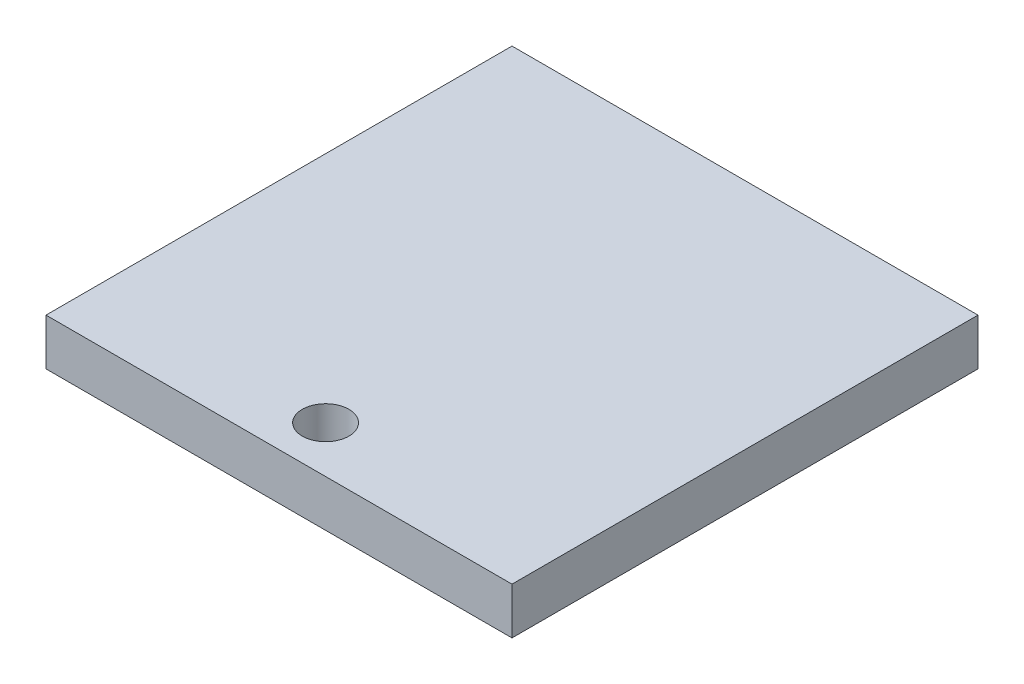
ISO-10303-21;
HEADER;
FILE_DESCRIPTION(('STEP AP214'),'2;1');
FILE_NAME('part.step','',(''),(''),'','','');
FILE_SCHEMA(('AUTOMOTIVE_DESIGN { 1 0 10303 214 1 1 1 1 }'));
ENDSEC;
DATA;
#1=APPLICATION_CONTEXT('core data for automotive mechanical design processes');
#2=APPLICATION_PROTOCOL_DEFINITION('international standard','automotive_design',2000,#1);
#3=PRODUCT_CONTEXT('',#1,'mechanical');
#4=PRODUCT('Part','Part','',(#3));
#5=PRODUCT_RELATED_PRODUCT_CATEGORY('part','',(#4));
#6=PRODUCT_DEFINITION_FORMATION('','',#4);
#7=PRODUCT_DEFINITION_CONTEXT('part definition',#1,'design');
#8=PRODUCT_DEFINITION('design','',#6,#7);
#9=PRODUCT_DEFINITION_SHAPE('','',#8);
#10=(LENGTH_UNIT() NAMED_UNIT(*) SI_UNIT(.MILLI.,.METRE.));
#11=(NAMED_UNIT(*) PLANE_ANGLE_UNIT() SI_UNIT($,.RADIAN.));
#12=(NAMED_UNIT(*) SI_UNIT($,.STERADIAN.) SOLID_ANGLE_UNIT());
#13=UNCERTAINTY_MEASURE_WITH_UNIT(LENGTH_MEASURE(1.E-05),#10,'distance_accuracy_value','');
#14=(GEOMETRIC_REPRESENTATION_CONTEXT(3) GLOBAL_UNCERTAINTY_ASSIGNED_CONTEXT((#13)) GLOBAL_UNIT_ASSIGNED_CONTEXT((#10,
#11,#12)) REPRESENTATION_CONTEXT('',''));
#15=CARTESIAN_POINT('',(0.,0.,0.));
#16=DIRECTION('',(0.,0.,1.));
#17=DIRECTION('',(1.,0.,0.));
#18=AXIS2_PLACEMENT_3D('',#15,#16,#17);
#19=CARTESIAN_POINT('',(0.,5.,0.));
#20=DIRECTION('',(1.,0.,0.));
#21=DIRECTION('',(0.,0.,-1.));
#22=AXIS2_PLACEMENT_3D('',#19,#20,#21);
#23=PLANE('',#22);
#24=DIRECTION('',(0.,0.,1.));
#25=VECTOR('',#24,1.);
#26=CARTESIAN_POINT('',(0.,0.,0.));
#27=LINE('',#26,#25);
#28=CARTESIAN_POINT('',(0.,0.,-50.));
#29=VERTEX_POINT('',#28);
#30=CARTESIAN_POINT('',(0.,0.,0.));
#31=VERTEX_POINT('',#30);
#32=EDGE_CURVE('E77',#29,#31,#27,.T.);
#33=ORIENTED_EDGE('',*,*,#32,.T.);
#34=DIRECTION('',(0.,-1.,0.));
#35=VECTOR('',#34,1.);
#36=CARTESIAN_POINT('',(0.,5.,0.));
#37=LINE('',#36,#35);
#38=CARTESIAN_POINT('',(0.,5.,0.));
#39=VERTEX_POINT('',#38);
#40=EDGE_CURVE('E11',#39,#31,#37,.T.);
#41=ORIENTED_EDGE('',*,*,#40,.F.);
#42=DIRECTION('',(0.,0.,1.));
#43=VECTOR('',#42,1.);
#44=CARTESIAN_POINT('',(0.,5.,0.));
#45=LINE('',#44,#43);
#46=CARTESIAN_POINT('',(0.,5.,-50.));
#47=VERTEX_POINT('',#46);
#48=EDGE_CURVE('E100',#47,#39,#45,.T.);
#49=ORIENTED_EDGE('',*,*,#48,.F.);
#50=DIRECTION('',(0.,-1.,0.));
#51=VECTOR('',#50,1.);
#52=CARTESIAN_POINT('',(0.,5.,-50.));
#53=LINE('',#52,#51);
#54=EDGE_CURVE('E89',#47,#29,#53,.T.);
#55=ORIENTED_EDGE('',*,*,#54,.T.);
#56=EDGE_LOOP('',(#33,#41,#49,#55));
#57=FACE_BOUND('',#56,.T.);
#58=ADVANCED_FACE('F33',(#57),#23,.F.);
#59=CARTESIAN_POINT('',(0.,5.,0.));
#60=DIRECTION('',(0.,0.,-1.));
#61=DIRECTION('',(-1.,0.,0.));
#62=AXIS2_PLACEMENT_3D('',#59,#60,#61);
#63=PLANE('',#62);
#64=DIRECTION('',(1.,0.,0.));
#65=VECTOR('',#64,1.);
#66=CARTESIAN_POINT('',(0.,0.,0.));
#67=LINE('',#66,#65);
#68=CARTESIAN_POINT('',(50.,0.,0.));
#69=VERTEX_POINT('',#68);
#70=EDGE_CURVE('E73',#31,#69,#67,.T.);
#71=ORIENTED_EDGE('',*,*,#70,.T.);
#72=DIRECTION('',(0.,-1.,0.));
#73=VECTOR('',#72,1.);
#74=CARTESIAN_POINT('',(50.,5.,0.));
#75=LINE('',#74,#73);
#76=CARTESIAN_POINT('',(50.,5.,0.));
#77=VERTEX_POINT('',#76);
#78=EDGE_CURVE('E40',#77,#69,#75,.T.);
#79=ORIENTED_EDGE('',*,*,#78,.F.);
#80=DIRECTION('',(1.,0.,0.));
#81=VECTOR('',#80,1.);
#82=CARTESIAN_POINT('',(0.,5.,0.));
#83=LINE('',#82,#81);
#84=EDGE_CURVE('E85',#39,#77,#83,.T.);
#85=ORIENTED_EDGE('',*,*,#84,.F.);
#86=ORIENTED_EDGE('',*,*,#40,.T.);
#87=EDGE_LOOP('',(#71,#79,#85,#86));
#88=FACE_BOUND('',#87,.T.);
#89=ADVANCED_FACE('F84',(#88),#63,.F.);
#90=CARTESIAN_POINT('',(50.,5.,0.));
#91=DIRECTION('',(-1.,0.,0.));
#92=DIRECTION('',(0.,0.,1.));
#93=AXIS2_PLACEMENT_3D('',#90,#91,#92);
#94=PLANE('',#93);
#95=DIRECTION('',(0.,0.,-1.));
#96=VECTOR('',#95,1.);
#97=CARTESIAN_POINT('',(50.,0.,0.));
#98=LINE('',#97,#96);
#99=CARTESIAN_POINT('',(50.,0.,-50.));
#100=VERTEX_POINT('',#99);
#101=EDGE_CURVE('E78',#69,#100,#98,.T.);
#102=ORIENTED_EDGE('',*,*,#101,.T.);
#103=DIRECTION('',(0.,-1.,0.));
#104=VECTOR('',#103,1.);
#105=CARTESIAN_POINT('',(50.,5.,-50.));
#106=LINE('',#105,#104);
#107=CARTESIAN_POINT('',(50.,5.,-50.));
#108=VERTEX_POINT('',#107);
#109=EDGE_CURVE('E106',#108,#100,#106,.T.);
#110=ORIENTED_EDGE('',*,*,#109,.F.);
#111=DIRECTION('',(0.,0.,-1.));
#112=VECTOR('',#111,1.);
#113=CARTESIAN_POINT('',(50.,5.,0.));
#114=LINE('',#113,#112);
#115=EDGE_CURVE('E52',#77,#108,#114,.T.);
#116=ORIENTED_EDGE('',*,*,#115,.F.);
#117=ORIENTED_EDGE('',*,*,#78,.T.);
#118=EDGE_LOOP('',(#102,#110,#116,#117));
#119=FACE_BOUND('',#118,.T.);
#120=ADVANCED_FACE('F109',(#119),#94,.F.);
#121=CARTESIAN_POINT('',(0.,5.,-50.));
#122=DIRECTION('',(0.,0.,1.));
#123=DIRECTION('',(1.,0.,0.));
#124=AXIS2_PLACEMENT_3D('',#121,#122,#123);
#125=PLANE('',#124);
#126=DIRECTION('',(-1.,0.,0.));
#127=VECTOR('',#126,1.);
#128=CARTESIAN_POINT('',(0.,0.,-50.));
#129=LINE('',#128,#127);
#130=EDGE_CURVE('E98',#100,#29,#129,.T.);
#131=ORIENTED_EDGE('',*,*,#130,.T.);
#132=ORIENTED_EDGE('',*,*,#54,.F.);
#133=DIRECTION('',(-1.,0.,0.));
#134=VECTOR('',#133,1.);
#135=CARTESIAN_POINT('',(0.,5.,-50.));
#136=LINE('',#135,#134);
#137=EDGE_CURVE('E47',#108,#47,#136,.T.);
#138=ORIENTED_EDGE('',*,*,#137,.F.);
#139=ORIENTED_EDGE('',*,*,#109,.T.);
#140=EDGE_LOOP('',(#131,#132,#138,#139));
#141=FACE_BOUND('',#140,.T.);
#142=ADVANCED_FACE('F111',(#141),#125,.F.);
#143=CARTESIAN_POINT('',(0.,5.,-50.));
#144=DIRECTION('',(0.,-1.,0.));
#145=DIRECTION('',(0.,0.,-1.));
#146=AXIS2_PLACEMENT_3D('',#143,#144,#145);
#147=PLANE('',#146);
#148=CARTESIAN_POINT('',(25.,5.,-5.));
#149=DIRECTION('',(0.,1.,0.));
#150=DIRECTION('',(0.,0.,1.));
#151=AXIS2_PLACEMENT_3D('',#148,#149,#150);
#152=CIRCLE('',#151,2.5);
#153=CARTESIAN_POINT('',(25.,5.,-2.5));
#154=VERTEX_POINT('',#153);
#155=EDGE_CURVE('E93',#154,#154,#152,.T.);
#156=ORIENTED_EDGE('',*,*,#155,.F.);
#157=EDGE_LOOP('',(#156));
#158=FACE_BOUND('',#157,.T.);
#159=ORIENTED_EDGE('',*,*,#48,.T.);
#160=ORIENTED_EDGE('',*,*,#84,.T.);
#161=ORIENTED_EDGE('',*,*,#115,.T.);
#162=ORIENTED_EDGE('',*,*,#137,.T.);
#163=EDGE_LOOP('',(#159,#160,#161,#162));
#164=FACE_BOUND('',#163,.T.);
#165=ADVANCED_FACE('F112',(#158,#164),#147,.F.);
#166=CARTESIAN_POINT('',(0.,0.,-50.));
#167=DIRECTION('',(0.,-1.,0.));
#168=DIRECTION('',(0.,0.,-1.));
#169=AXIS2_PLACEMENT_3D('',#166,#167,#168);
#170=PLANE('',#169);
#171=CARTESIAN_POINT('',(25.,0.,-5.));
#172=DIRECTION('',(0.,1.,0.));
#173=DIRECTION('',(0.,0.,1.));
#174=AXIS2_PLACEMENT_3D('',#171,#172,#173);
#175=CIRCLE('',#174,2.5);
#176=CARTESIAN_POINT('',(25.,0.,-2.5));
#177=VERTEX_POINT('',#176);
#178=EDGE_CURVE('E90',#177,#177,#175,.T.);
#179=ORIENTED_EDGE('',*,*,#178,.T.);
#180=EDGE_LOOP('',(#179));
#181=FACE_BOUND('',#180,.T.);
#182=ORIENTED_EDGE('',*,*,#32,.F.);
#183=ORIENTED_EDGE('',*,*,#130,.F.);
#184=ORIENTED_EDGE('',*,*,#101,.F.);
#185=ORIENTED_EDGE('',*,*,#70,.F.);
#186=EDGE_LOOP('',(#182,#183,#184,#185));
#187=FACE_BOUND('',#186,.T.);
#188=ADVANCED_FACE('F74',(#181,#187),#170,.T.);
#189=CARTESIAN_POINT('',(25.,0.,-5.));
#190=DIRECTION('',(0.,1.,0.));
#191=DIRECTION('',(0.,0.,1.));
#192=AXIS2_PLACEMENT_3D('',#189,#190,#191);
#193=CYLINDRICAL_SURFACE('',#192,2.5);
#194=ORIENTED_EDGE('',*,*,#178,.F.);
#195=EDGE_LOOP('',(#194));
#196=FACE_BOUND('',#195,.T.);
#197=ORIENTED_EDGE('',*,*,#155,.T.);
#198=EDGE_LOOP('',(#197));
#199=FACE_BOUND('',#198,.T.);
#200=ADVANCED_FACE('F120',(#196,#199),#193,.F.);
#201=CLOSED_SHELL('',(#58,#89,#120,#142,#165,#188,#200));
#202=MANIFOLD_SOLID_BREP('B2',#201);
#203=ADVANCED_BREP_SHAPE_REPRESENTATION('',(#18,#202),#14);
#204=SHAPE_DEFINITION_REPRESENTATION(#9,#203);
ENDSEC;
END-ISO-10303-21;
